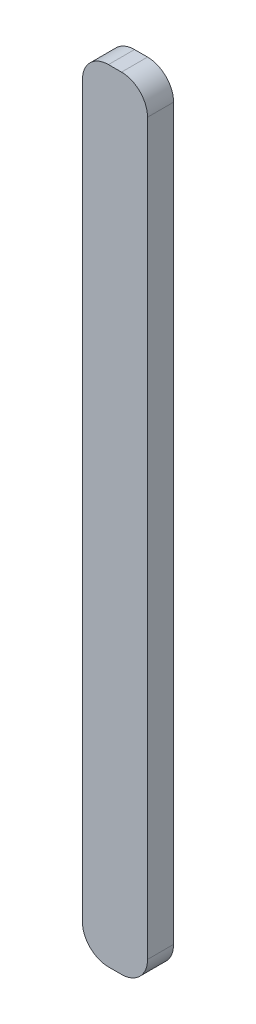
ISO-10303-21;
HEADER;
FILE_DESCRIPTION(('STEP AP214'),'2;1');
FILE_NAME('part.step','',(''),(''),'','','');
FILE_SCHEMA(('AUTOMOTIVE_DESIGN { 1 0 10303 214 1 1 1 1 }'));
ENDSEC;
DATA;
#1=APPLICATION_CONTEXT('core data for automotive mechanical design processes');
#2=APPLICATION_PROTOCOL_DEFINITION('international standard','automotive_design',2000,#1);
#3=PRODUCT_CONTEXT('',#1,'mechanical');
#4=PRODUCT('Part','Part','',(#3));
#5=PRODUCT_RELATED_PRODUCT_CATEGORY('part','',(#4));
#6=PRODUCT_DEFINITION_FORMATION('','',#4);
#7=PRODUCT_DEFINITION_CONTEXT('part definition',#1,'design');
#8=PRODUCT_DEFINITION('design','',#6,#7);
#9=PRODUCT_DEFINITION_SHAPE('','',#8);
#10=(LENGTH_UNIT() NAMED_UNIT(*) SI_UNIT(.MILLI.,.METRE.));
#11=(NAMED_UNIT(*) PLANE_ANGLE_UNIT() SI_UNIT($,.RADIAN.));
#12=(NAMED_UNIT(*) SI_UNIT($,.STERADIAN.) SOLID_ANGLE_UNIT());
#13=UNCERTAINTY_MEASURE_WITH_UNIT(LENGTH_MEASURE(1.E-05),#10,'distance_accuracy_value','');
#14=(GEOMETRIC_REPRESENTATION_CONTEXT(3) GLOBAL_UNCERTAINTY_ASSIGNED_CONTEXT((#13)) GLOBAL_UNIT_ASSIGNED_CONTEXT((#10,
#11,#12)) REPRESENTATION_CONTEXT('',''));
#15=CARTESIAN_POINT('',(0.,0.,0.));
#16=DIRECTION('',(0.,0.,1.));
#17=DIRECTION('',(1.,0.,0.));
#18=AXIS2_PLACEMENT_3D('',#15,#16,#17);
#19=CARTESIAN_POINT('',(2.50000000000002,-140.,10.));
#20=DIRECTION('',(0.,0.,-1.));
#21=DIRECTION('',(-1.,0.,0.));
#22=AXIS2_PLACEMENT_3D('',#19,#20,#21);
#23=CYLINDRICAL_SURFACE('',#22,10.);
#24=CARTESIAN_POINT('',(2.50000000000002,-140.,0.));
#25=DIRECTION('',(0.,0.,1.));
#26=DIRECTION('',(1.,0.,0.));
#27=AXIS2_PLACEMENT_3D('',#24,#25,#26);
#28=CIRCLE('',#27,10.);
#29=CARTESIAN_POINT('',(2.49999999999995,-150.,0.));
#30=VERTEX_POINT('',#29);
#31=CARTESIAN_POINT('',(12.5,-140.,0.));
#32=VERTEX_POINT('',#31);
#33=EDGE_CURVE('E140',#30,#32,#28,.T.);
#34=ORIENTED_EDGE('',*,*,#33,.T.);
#35=DIRECTION('',(0.,0.,-1.));
#36=VECTOR('',#35,1.);
#37=CARTESIAN_POINT('',(12.5,-140.,10.));
#38=LINE('',#37,#36);
#39=CARTESIAN_POINT('',(12.5,-140.,10.));
#40=VERTEX_POINT('',#39);
#41=EDGE_CURVE('E11',#40,#32,#38,.T.);
#42=ORIENTED_EDGE('',*,*,#41,.F.);
#43=CARTESIAN_POINT('',(2.50000000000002,-140.,10.));
#44=DIRECTION('',(0.,0.,1.));
#45=DIRECTION('',(1.,0.,0.));
#46=AXIS2_PLACEMENT_3D('',#43,#44,#45);
#47=CIRCLE('',#46,10.);
#48=CARTESIAN_POINT('',(2.49999999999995,-150.,10.));
#49=VERTEX_POINT('',#48);
#50=EDGE_CURVE('E162',#49,#40,#47,.T.);
#51=ORIENTED_EDGE('',*,*,#50,.F.);
#52=DIRECTION('',(0.,0.,-1.));
#53=VECTOR('',#52,1.);
#54=CARTESIAN_POINT('',(2.49999999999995,-150.,10.));
#55=LINE('',#54,#53);
#56=EDGE_CURVE('E136',#49,#30,#55,.T.);
#57=ORIENTED_EDGE('',*,*,#56,.T.);
#58=EDGE_LOOP('',(#34,#42,#51,#57));
#59=FACE_BOUND('',#58,.T.);
#60=ADVANCED_FACE('F39',(#59),#23,.T.);
#61=CARTESIAN_POINT('',(12.5,140.,10.));
#62=DIRECTION('',(-1.,0.,0.));
#63=DIRECTION('',(0.,-1.,0.));
#64=AXIS2_PLACEMENT_3D('',#61,#62,#63);
#65=PLANE('',#64);
#66=DIRECTION('',(0.,1.,0.));
#67=VECTOR('',#66,1.);
#68=CARTESIAN_POINT('',(12.5,140.,0.));
#69=LINE('',#68,#67);
#70=CARTESIAN_POINT('',(12.5,140.,0.));
#71=VERTEX_POINT('',#70);
#72=EDGE_CURVE('E144',#32,#71,#69,.T.);
#73=ORIENTED_EDGE('',*,*,#72,.T.);
#74=DIRECTION('',(0.,0.,-1.));
#75=VECTOR('',#74,1.);
#76=CARTESIAN_POINT('',(12.5,140.,10.));
#77=LINE('',#76,#75);
#78=CARTESIAN_POINT('',(12.5,140.,10.));
#79=VERTEX_POINT('',#78);
#80=EDGE_CURVE('E48',#79,#71,#77,.T.);
#81=ORIENTED_EDGE('',*,*,#80,.F.);
#82=DIRECTION('',(0.,1.,0.));
#83=VECTOR('',#82,1.);
#84=CARTESIAN_POINT('',(12.5,140.,10.));
#85=LINE('',#84,#83);
#86=EDGE_CURVE('E99',#40,#79,#85,.T.);
#87=ORIENTED_EDGE('',*,*,#86,.F.);
#88=ORIENTED_EDGE('',*,*,#41,.T.);
#89=EDGE_LOOP('',(#73,#81,#87,#88));
#90=FACE_BOUND('',#89,.T.);
#91=ADVANCED_FACE('F208',(#90),#65,.F.);
#92=CARTESIAN_POINT('',(2.49999999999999,140.,10.));
#93=DIRECTION('',(0.,0.,-1.));
#94=DIRECTION('',(-1.,0.,0.));
#95=AXIS2_PLACEMENT_3D('',#92,#93,#94);
#96=CYLINDRICAL_SURFACE('',#95,10.);
#97=CARTESIAN_POINT('',(2.49999999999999,140.,0.));
#98=DIRECTION('',(0.,0.,1.));
#99=DIRECTION('',(1.,0.,0.));
#100=AXIS2_PLACEMENT_3D('',#97,#98,#99);
#101=CIRCLE('',#100,10.);
#102=CARTESIAN_POINT('',(2.49999999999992,150.,0.));
#103=VERTEX_POINT('',#102);
#104=EDGE_CURVE('E147',#71,#103,#101,.T.);
#105=ORIENTED_EDGE('',*,*,#104,.T.);
#106=DIRECTION('',(0.,0.,-1.));
#107=VECTOR('',#106,1.);
#108=CARTESIAN_POINT('',(2.49999999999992,150.,10.));
#109=LINE('',#108,#107);
#110=CARTESIAN_POINT('',(2.49999999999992,150.,10.));
#111=VERTEX_POINT('',#110);
#112=EDGE_CURVE('E173',#111,#103,#109,.T.);
#113=ORIENTED_EDGE('',*,*,#112,.F.);
#114=CARTESIAN_POINT('',(2.49999999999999,140.,10.));
#115=DIRECTION('',(0.,0.,1.));
#116=DIRECTION('',(1.,0.,0.));
#117=AXIS2_PLACEMENT_3D('',#114,#115,#116);
#118=CIRCLE('',#117,10.);
#119=EDGE_CURVE('E183',#79,#111,#118,.T.);
#120=ORIENTED_EDGE('',*,*,#119,.F.);
#121=ORIENTED_EDGE('',*,*,#80,.T.);
#122=EDGE_LOOP('',(#105,#113,#120,#121));
#123=FACE_BOUND('',#122,.T.);
#124=ADVANCED_FACE('F181',(#123),#96,.T.);
#125=CARTESIAN_POINT('',(-2.49999999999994,150.,10.));
#126=DIRECTION('',(0.,-1.,0.));
#127=DIRECTION('',(0.,0.,-1.));
#128=AXIS2_PLACEMENT_3D('',#125,#126,#127);
#129=PLANE('',#128);
#130=DIRECTION('',(-1.,0.,0.));
#131=VECTOR('',#130,1.);
#132=CARTESIAN_POINT('',(-2.49999999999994,150.,0.));
#133=LINE('',#132,#131);
#134=CARTESIAN_POINT('',(-2.49999999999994,150.,0.));
#135=VERTEX_POINT('',#134);
#136=EDGE_CURVE('E150',#103,#135,#133,.T.);
#137=ORIENTED_EDGE('',*,*,#136,.T.);
#138=DIRECTION('',(0.,0.,-1.));
#139=VECTOR('',#138,1.);
#140=CARTESIAN_POINT('',(-2.49999999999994,150.,10.));
#141=LINE('',#140,#139);
#142=CARTESIAN_POINT('',(-2.49999999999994,150.,10.));
#143=VERTEX_POINT('',#142);
#144=EDGE_CURVE('E169',#143,#135,#141,.T.);
#145=ORIENTED_EDGE('',*,*,#144,.F.);
#146=DIRECTION('',(-1.,0.,0.));
#147=VECTOR('',#146,1.);
#148=CARTESIAN_POINT('',(-2.49999999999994,150.,10.));
#149=LINE('',#148,#147);
#150=EDGE_CURVE('E196',#111,#143,#149,.T.);
#151=ORIENTED_EDGE('',*,*,#150,.F.);
#152=ORIENTED_EDGE('',*,*,#112,.T.);
#153=EDGE_LOOP('',(#137,#145,#151,#152));
#154=FACE_BOUND('',#153,.T.);
#155=ADVANCED_FACE('F191',(#154),#129,.F.);
#156=CARTESIAN_POINT('',(-2.50000000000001,140.,10.));
#157=DIRECTION('',(0.,0.,-1.));
#158=DIRECTION('',(-1.,0.,0.));
#159=AXIS2_PLACEMENT_3D('',#156,#157,#158);
#160=CYLINDRICAL_SURFACE('',#159,10.);
#161=CARTESIAN_POINT('',(-2.50000000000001,140.,0.));
#162=DIRECTION('',(0.,0.,1.));
#163=DIRECTION('',(-1.,0.,0.));
#164=AXIS2_PLACEMENT_3D('',#161,#162,#163);
#165=CIRCLE('',#164,10.);
#166=CARTESIAN_POINT('',(-12.5,140.,0.));
#167=VERTEX_POINT('',#166);
#168=EDGE_CURVE('E153',#135,#167,#165,.T.);
#169=ORIENTED_EDGE('',*,*,#168,.T.);
#170=DIRECTION('',(0.,0.,-1.));
#171=VECTOR('',#170,1.);
#172=CARTESIAN_POINT('',(-12.5,140.,10.));
#173=LINE('',#172,#171);
#174=CARTESIAN_POINT('',(-12.5,140.,10.));
#175=VERTEX_POINT('',#174);
#176=EDGE_CURVE('E129',#175,#167,#173,.T.);
#177=ORIENTED_EDGE('',*,*,#176,.F.);
#178=CARTESIAN_POINT('',(-2.50000000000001,140.,10.));
#179=DIRECTION('',(0.,0.,1.));
#180=DIRECTION('',(-1.,0.,0.));
#181=AXIS2_PLACEMENT_3D('',#178,#179,#180);
#182=CIRCLE('',#181,10.);
#183=EDGE_CURVE('E118',#143,#175,#182,.T.);
#184=ORIENTED_EDGE('',*,*,#183,.F.);
#185=ORIENTED_EDGE('',*,*,#144,.T.);
#186=EDGE_LOOP('',(#169,#177,#184,#185));
#187=FACE_BOUND('',#186,.T.);
#188=ADVANCED_FACE('F194',(#187),#160,.T.);
#189=CARTESIAN_POINT('',(-12.5,140.,10.));
#190=DIRECTION('',(1.,0.,0.));
#191=DIRECTION('',(0.,1.,0.));
#192=AXIS2_PLACEMENT_3D('',#189,#190,#191);
#193=PLANE('',#192);
#194=DIRECTION('',(0.,-1.,0.));
#195=VECTOR('',#194,1.);
#196=CARTESIAN_POINT('',(-12.5,140.,0.));
#197=LINE('',#196,#195);
#198=CARTESIAN_POINT('',(-12.5,-140.,0.));
#199=VERTEX_POINT('',#198);
#200=EDGE_CURVE('E127',#167,#199,#197,.T.);
#201=ORIENTED_EDGE('',*,*,#200,.T.);
#202=DIRECTION('',(0.,0.,-1.));
#203=VECTOR('',#202,1.);
#204=CARTESIAN_POINT('',(-12.5,-140.,10.));
#205=LINE('',#204,#203);
#206=CARTESIAN_POINT('',(-12.5,-140.,10.));
#207=VERTEX_POINT('',#206);
#208=EDGE_CURVE('E124',#207,#199,#205,.T.);
#209=ORIENTED_EDGE('',*,*,#208,.F.);
#210=DIRECTION('',(0.,-1.,0.));
#211=VECTOR('',#210,1.);
#212=CARTESIAN_POINT('',(-12.5,140.,10.));
#213=LINE('',#212,#211);
#214=EDGE_CURVE('E112',#175,#207,#213,.T.);
#215=ORIENTED_EDGE('',*,*,#214,.F.);
#216=ORIENTED_EDGE('',*,*,#176,.T.);
#217=EDGE_LOOP('',(#201,#209,#215,#216));
#218=FACE_BOUND('',#217,.T.);
#219=ADVANCED_FACE('F125',(#218),#193,.F.);
#220=CARTESIAN_POINT('',(-2.49999999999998,-140.,10.));
#221=DIRECTION('',(0.,0.,-1.));
#222=DIRECTION('',(-1.,0.,0.));
#223=AXIS2_PLACEMENT_3D('',#220,#221,#222);
#224=CYLINDRICAL_SURFACE('',#223,10.);
#225=CARTESIAN_POINT('',(-2.49999999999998,-140.,0.));
#226=DIRECTION('',(0.,0.,1.));
#227=DIRECTION('',(-1.,0.,0.));
#228=AXIS2_PLACEMENT_3D('',#225,#226,#227);
#229=CIRCLE('',#228,10.);
#230=CARTESIAN_POINT('',(-2.49999999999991,-150.,0.));
#231=VERTEX_POINT('',#230);
#232=EDGE_CURVE('E85',#199,#231,#229,.T.);
#233=ORIENTED_EDGE('',*,*,#232,.T.);
#234=DIRECTION('',(0.,0.,-1.));
#235=VECTOR('',#234,1.);
#236=CARTESIAN_POINT('',(-2.49999999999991,-150.,10.));
#237=LINE('',#236,#235);
#238=CARTESIAN_POINT('',(-2.49999999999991,-150.,10.));
#239=VERTEX_POINT('',#238);
#240=EDGE_CURVE('E130',#239,#231,#237,.T.);
#241=ORIENTED_EDGE('',*,*,#240,.F.);
#242=CARTESIAN_POINT('',(-2.49999999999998,-140.,10.));
#243=DIRECTION('',(0.,0.,1.));
#244=DIRECTION('',(-1.,0.,0.));
#245=AXIS2_PLACEMENT_3D('',#242,#243,#244);
#246=CIRCLE('',#245,10.);
#247=EDGE_CURVE('E116',#207,#239,#246,.T.);
#248=ORIENTED_EDGE('',*,*,#247,.F.);
#249=ORIENTED_EDGE('',*,*,#208,.T.);
#250=EDGE_LOOP('',(#233,#241,#248,#249));
#251=FACE_BOUND('',#250,.T.);
#252=ADVANCED_FACE('F132',(#251),#224,.T.);
#253=CARTESIAN_POINT('',(-2.49999999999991,-150.,10.));
#254=DIRECTION('',(0.,1.,0.));
#255=DIRECTION('',(0.,0.,1.));
#256=AXIS2_PLACEMENT_3D('',#253,#254,#255);
#257=PLANE('',#256);
#258=DIRECTION('',(1.,0.,0.));
#259=VECTOR('',#258,1.);
#260=CARTESIAN_POINT('',(-2.49999999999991,-150.,0.));
#261=LINE('',#260,#259);
#262=EDGE_CURVE('E91',#231,#30,#261,.T.);
#263=ORIENTED_EDGE('',*,*,#262,.T.);
#264=ORIENTED_EDGE('',*,*,#56,.F.);
#265=DIRECTION('',(1.,0.,0.));
#266=VECTOR('',#265,1.);
#267=CARTESIAN_POINT('',(-2.49999999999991,-150.,10.));
#268=LINE('',#267,#266);
#269=EDGE_CURVE('E56',#239,#49,#268,.T.);
#270=ORIENTED_EDGE('',*,*,#269,.F.);
#271=ORIENTED_EDGE('',*,*,#240,.T.);
#272=EDGE_LOOP('',(#263,#264,#270,#271));
#273=FACE_BOUND('',#272,.T.);
#274=ADVANCED_FACE('F224',(#273),#257,.F.);
#275=CARTESIAN_POINT('',(2.50000000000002,-140.,10.));
#276=DIRECTION('',(0.,0.,1.));
#277=DIRECTION('',(1.,0.,0.));
#278=AXIS2_PLACEMENT_3D('',#275,#276,#277);
#279=PLANE('',#278);
#280=ORIENTED_EDGE('',*,*,#50,.T.);
#281=ORIENTED_EDGE('',*,*,#86,.T.);
#282=ORIENTED_EDGE('',*,*,#119,.T.);
#283=ORIENTED_EDGE('',*,*,#150,.T.);
#284=ORIENTED_EDGE('',*,*,#183,.T.);
#285=ORIENTED_EDGE('',*,*,#214,.T.);
#286=ORIENTED_EDGE('',*,*,#247,.T.);
#287=ORIENTED_EDGE('',*,*,#269,.T.);
#288=EDGE_LOOP('',(#280,#281,#282,#283,#284,#285,#286,#287));
#289=FACE_BOUND('',#288,.T.);
#290=ADVANCED_FACE('F114',(#289),#279,.T.);
#291=CARTESIAN_POINT('',(2.50000000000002,-140.,0.));
#292=DIRECTION('',(0.,0.,1.));
#293=DIRECTION('',(1.,0.,0.));
#294=AXIS2_PLACEMENT_3D('',#291,#292,#293);
#295=PLANE('',#294);
#296=ORIENTED_EDGE('',*,*,#33,.F.);
#297=ORIENTED_EDGE('',*,*,#262,.F.);
#298=ORIENTED_EDGE('',*,*,#232,.F.);
#299=ORIENTED_EDGE('',*,*,#200,.F.);
#300=ORIENTED_EDGE('',*,*,#168,.F.);
#301=ORIENTED_EDGE('',*,*,#136,.F.);
#302=ORIENTED_EDGE('',*,*,#104,.F.);
#303=ORIENTED_EDGE('',*,*,#72,.F.);
#304=EDGE_LOOP('',(#296,#297,#298,#299,#300,#301,#302,#303));
#305=FACE_BOUND('',#304,.T.);
#306=ADVANCED_FACE('F187',(#305),#295,.F.);
#307=CLOSED_SHELL('',(#60,#91,#124,#155,#188,#219,#252,#274,#290,#306));
#308=MANIFOLD_SOLID_BREP('B2',#307);
#309=ADVANCED_BREP_SHAPE_REPRESENTATION('',(#18,#308),#14);
#310=SHAPE_DEFINITION_REPRESENTATION(#9,#309);
ENDSEC;
END-ISO-10303-21;
